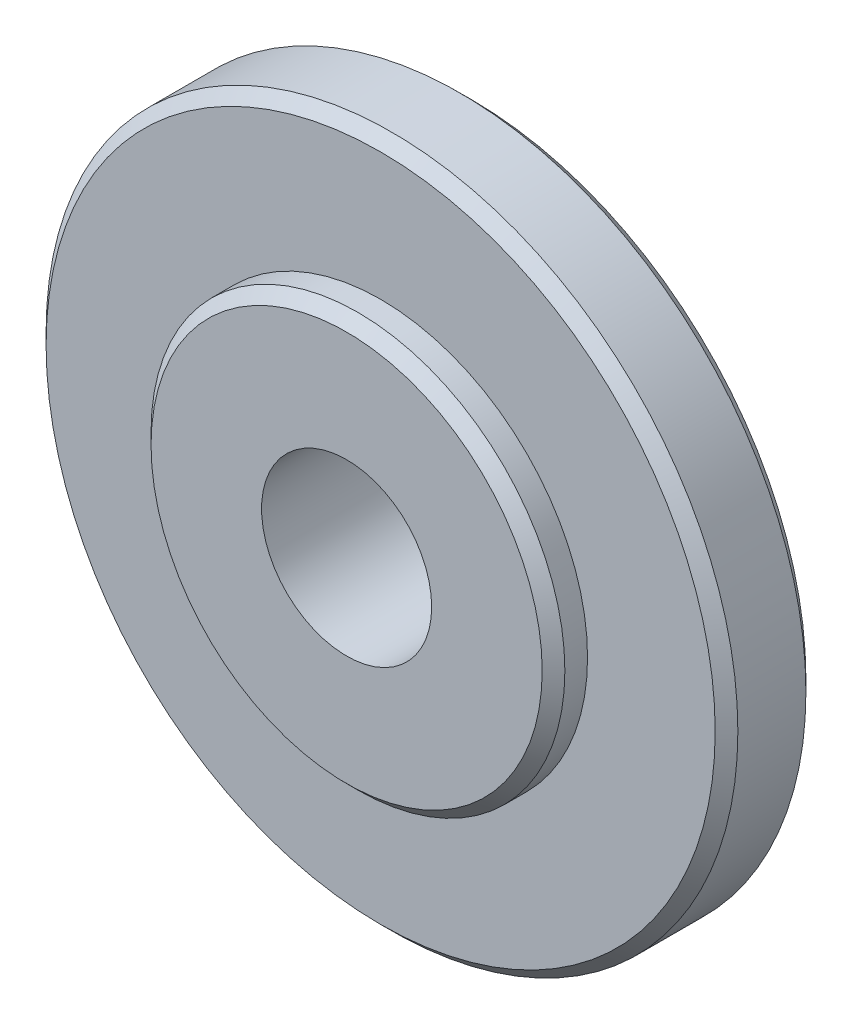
ISO-10303-21;
HEADER;
FILE_DESCRIPTION(('STEP AP214'),'2;1');
FILE_NAME('part.step','',(''),(''),'','','');
FILE_SCHEMA(('AUTOMOTIVE_DESIGN { 1 0 10303 214 1 1 1 1 }'));
ENDSEC;
DATA;
#1=APPLICATION_CONTEXT('core data for automotive mechanical design processes');
#2=APPLICATION_PROTOCOL_DEFINITION('international standard','automotive_design',2000,#1);
#3=PRODUCT_CONTEXT('',#1,'mechanical');
#4=PRODUCT('Part','Part','',(#3));
#5=PRODUCT_RELATED_PRODUCT_CATEGORY('part','',(#4));
#6=PRODUCT_DEFINITION_FORMATION('','',#4);
#7=PRODUCT_DEFINITION_CONTEXT('part definition',#1,'design');
#8=PRODUCT_DEFINITION('design','',#6,#7);
#9=PRODUCT_DEFINITION_SHAPE('','',#8);
#10=(LENGTH_UNIT() NAMED_UNIT(*) SI_UNIT(.MILLI.,.METRE.));
#11=(NAMED_UNIT(*) PLANE_ANGLE_UNIT() SI_UNIT($,.RADIAN.));
#12=(NAMED_UNIT(*) SI_UNIT($,.STERADIAN.) SOLID_ANGLE_UNIT());
#13=UNCERTAINTY_MEASURE_WITH_UNIT(LENGTH_MEASURE(1.E-05),#10,'distance_accuracy_value','');
#14=(GEOMETRIC_REPRESENTATION_CONTEXT(3) GLOBAL_UNCERTAINTY_ASSIGNED_CONTEXT((#13)) GLOBAL_UNIT_ASSIGNED_CONTEXT((#10,
#11,#12)) REPRESENTATION_CONTEXT('',''));
#15=CARTESIAN_POINT('',(0.,0.,0.));
#16=DIRECTION('',(0.,0.,1.));
#17=DIRECTION('',(1.,0.,0.));
#18=AXIS2_PLACEMENT_3D('',#15,#16,#17);
#19=CARTESIAN_POINT('',(0.,18.2451617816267,-3.));
#20=DIRECTION('',(0.,0.,-1.));
#21=DIRECTION('',(-1.,0.,0.));
#22=AXIS2_PLACEMENT_3D('',#19,#20,#21);
#23=PLANE('',#22);
#24=CARTESIAN_POINT('',(0.,0.,-3.));
#25=DIRECTION('',(0.,0.,1.));
#26=DIRECTION('',(1.,0.,0.));
#27=AXIS2_PLACEMENT_3D('',#24,#25,#26);
#28=CIRCLE('',#27,18.2451617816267);
#29=CARTESIAN_POINT('',(18.2451617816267,0.,-3.));
#30=VERTEX_POINT('',#29);
#31=EDGE_CURVE('E61',#30,#30,#28,.T.);
#32=ORIENTED_EDGE('',*,*,#31,.F.);
#33=EDGE_LOOP('',(#32));
#34=FACE_BOUND('',#33,.T.);
#35=CARTESIAN_POINT('',(0.,0.,-3.));
#36=DIRECTION('',(0.,0.,1.));
#37=DIRECTION('',(1.,0.,0.));
#38=AXIS2_PLACEMENT_3D('',#35,#36,#37);
#39=CIRCLE('',#38,29.5);
#40=CARTESIAN_POINT('',(29.5,0.,-3.));
#41=VERTEX_POINT('',#40);
#42=EDGE_CURVE('E10',#41,#41,#39,.T.);
#43=ORIENTED_EDGE('',*,*,#42,.T.);
#44=EDGE_LOOP('',(#43));
#45=FACE_BOUND('',#44,.T.);
#46=ADVANCED_FACE('F30',(#34,#45),#23,.F.);
#47=CARTESIAN_POINT('',(0.,0.,-4.));
#48=DIRECTION('',(0.,0.,-1.));
#49=DIRECTION('',(-1.,0.,0.));
#50=AXIS2_PLACEMENT_3D('',#47,#48,#49);
#51=CONICAL_SURFACE('',#50,30.5,0.78539816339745);
#52=ORIENTED_EDGE('',*,*,#42,.F.);
#53=EDGE_LOOP('',(#52));
#54=FACE_BOUND('',#53,.T.);
#55=CARTESIAN_POINT('',(0.,0.,-4.));
#56=DIRECTION('',(0.,0.,1.));
#57=DIRECTION('',(1.,0.,0.));
#58=AXIS2_PLACEMENT_3D('',#55,#56,#57);
#59=CIRCLE('',#58,30.5);
#60=CARTESIAN_POINT('',(30.5,0.,-4.));
#61=VERTEX_POINT('',#60);
#62=EDGE_CURVE('E36',#61,#61,#59,.T.);
#63=ORIENTED_EDGE('',*,*,#62,.T.);
#64=EDGE_LOOP('',(#63));
#65=FACE_BOUND('',#64,.T.);
#66=ADVANCED_FACE('F68',(#54,#65),#51,.T.);
#67=CARTESIAN_POINT('',(0.,0.,0.));
#68=DIRECTION('',(0.,0.,1.));
#69=DIRECTION('',(1.,0.,0.));
#70=AXIS2_PLACEMENT_3D('',#67,#68,#69);
#71=CYLINDRICAL_SURFACE('',#70,30.5);
#72=ORIENTED_EDGE('',*,*,#62,.F.);
#73=EDGE_LOOP('',(#72));
#74=FACE_BOUND('',#73,.T.);
#75=CARTESIAN_POINT('',(0.,0.,-10.));
#76=DIRECTION('',(0.,0.,1.));
#77=DIRECTION('',(1.,0.,0.));
#78=AXIS2_PLACEMENT_3D('',#75,#76,#77);
#79=CIRCLE('',#78,30.5);
#80=CARTESIAN_POINT('',(30.5,0.,-10.));
#81=VERTEX_POINT('',#80);
#82=EDGE_CURVE('E40',#81,#81,#79,.T.);
#83=ORIENTED_EDGE('',*,*,#82,.T.);
#84=EDGE_LOOP('',(#83));
#85=FACE_BOUND('',#84,.T.);
#86=ADVANCED_FACE('F72',(#74,#85),#71,.T.);
#87=CARTESIAN_POINT('',(0.,0.,-11.));
#88=DIRECTION('',(0.,0.,1.));
#89=DIRECTION('',(1.,0.,0.));
#90=AXIS2_PLACEMENT_3D('',#87,#88,#89);
#91=CONICAL_SURFACE('',#90,29.5,0.785398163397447);
#92=ORIENTED_EDGE('',*,*,#82,.F.);
#93=EDGE_LOOP('',(#92));
#94=FACE_BOUND('',#93,.T.);
#95=CARTESIAN_POINT('',(0.,0.,-11.));
#96=DIRECTION('',(0.,0.,1.));
#97=DIRECTION('',(1.,0.,0.));
#98=AXIS2_PLACEMENT_3D('',#95,#96,#97);
#99=CIRCLE('',#98,29.5);
#100=CARTESIAN_POINT('',(29.5,0.,-11.));
#101=VERTEX_POINT('',#100);
#102=EDGE_CURVE('E44',#101,#101,#99,.T.);
#103=ORIENTED_EDGE('',*,*,#102,.T.);
#104=EDGE_LOOP('',(#103));
#105=FACE_BOUND('',#104,.T.);
#106=ADVANCED_FACE('F77',(#94,#105),#91,.T.);
#107=CARTESIAN_POINT('',(0.,29.5,-11.));
#108=DIRECTION('',(0.,0.,1.));
#109=DIRECTION('',(1.,0.,0.));
#110=AXIS2_PLACEMENT_3D('',#107,#108,#109);
#111=PLANE('',#110);
#112=ORIENTED_EDGE('',*,*,#102,.F.);
#113=EDGE_LOOP('',(#112));
#114=FACE_BOUND('',#113,.T.);
#115=CARTESIAN_POINT('',(0.,0.,-11.));
#116=DIRECTION('',(0.,0.,1.));
#117=DIRECTION('',(1.,0.,0.));
#118=AXIS2_PLACEMENT_3D('',#115,#116,#117);
#119=CIRCLE('',#118,7.5);
#120=CARTESIAN_POINT('',(7.5,0.,-11.));
#121=VERTEX_POINT('',#120);
#122=EDGE_CURVE('E49',#121,#121,#119,.T.);
#123=ORIENTED_EDGE('',*,*,#122,.T.);
#124=EDGE_LOOP('',(#123));
#125=FACE_BOUND('',#124,.T.);
#126=ADVANCED_FACE('F83',(#114,#125),#111,.F.);
#127=CARTESIAN_POINT('',(0.,0.,0.));
#128=DIRECTION('',(0.,0.,1.));
#129=DIRECTION('',(1.,0.,0.));
#130=AXIS2_PLACEMENT_3D('',#127,#128,#129);
#131=CYLINDRICAL_SURFACE('',#130,7.5);
#132=ORIENTED_EDGE('',*,*,#122,.F.);
#133=EDGE_LOOP('',(#132));
#134=FACE_BOUND('',#133,.T.);
#135=CARTESIAN_POINT('',(0.,0.,0.));
#136=DIRECTION('',(0.,0.,1.));
#137=DIRECTION('',(1.,0.,0.));
#138=AXIS2_PLACEMENT_3D('',#135,#136,#137);
#139=CIRCLE('',#138,7.5);
#140=CARTESIAN_POINT('',(7.5,0.,0.));
#141=VERTEX_POINT('',#140);
#142=EDGE_CURVE('E52',#141,#141,#139,.T.);
#143=ORIENTED_EDGE('',*,*,#142,.T.);
#144=EDGE_LOOP('',(#143));
#145=FACE_BOUND('',#144,.T.);
#146=ADVANCED_FACE('F87',(#134,#145),#131,.F.);
#147=CARTESIAN_POINT('',(0.,7.5,0.));
#148=DIRECTION('',(0.,0.,-1.));
#149=DIRECTION('',(-1.,0.,0.));
#150=AXIS2_PLACEMENT_3D('',#147,#148,#149);
#151=PLANE('',#150);
#152=ORIENTED_EDGE('',*,*,#142,.F.);
#153=EDGE_LOOP('',(#152));
#154=FACE_BOUND('',#153,.T.);
#155=CARTESIAN_POINT('',(0.,0.,0.));
#156=DIRECTION('',(0.,0.,1.));
#157=DIRECTION('',(1.,0.,0.));
#158=AXIS2_PLACEMENT_3D('',#155,#156,#157);
#159=CIRCLE('',#158,17.2451617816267);
#160=CARTESIAN_POINT('',(17.2451617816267,0.,0.));
#161=VERTEX_POINT('',#160);
#162=EDGE_CURVE('E55',#161,#161,#159,.T.);
#163=ORIENTED_EDGE('',*,*,#162,.T.);
#164=EDGE_LOOP('',(#163));
#165=FACE_BOUND('',#164,.T.);
#166=ADVANCED_FACE('F91',(#154,#165),#151,.F.);
#167=CARTESIAN_POINT('',(0.,0.,-0.999999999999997));
#168=DIRECTION('',(0.,0.,-1.));
#169=DIRECTION('',(-1.,0.,0.));
#170=AXIS2_PLACEMENT_3D('',#167,#168,#169);
#171=CONICAL_SURFACE('',#170,18.2451617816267,0.78539816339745);
#172=ORIENTED_EDGE('',*,*,#162,.F.);
#173=EDGE_LOOP('',(#172));
#174=FACE_BOUND('',#173,.T.);
#175=CARTESIAN_POINT('',(0.,0.,-0.999999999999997));
#176=DIRECTION('',(0.,0.,1.));
#177=DIRECTION('',(1.,0.,0.));
#178=AXIS2_PLACEMENT_3D('',#175,#176,#177);
#179=CIRCLE('',#178,18.2451617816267);
#180=CARTESIAN_POINT('',(18.2451617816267,0.,-0.999999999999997));
#181=VERTEX_POINT('',#180);
#182=EDGE_CURVE('E58',#181,#181,#179,.T.);
#183=ORIENTED_EDGE('',*,*,#182,.T.);
#184=EDGE_LOOP('',(#183));
#185=FACE_BOUND('',#184,.T.);
#186=ADVANCED_FACE('F95',(#174,#185),#171,.T.);
#187=CARTESIAN_POINT('',(0.,0.,0.));
#188=DIRECTION('',(0.,0.,1.));
#189=DIRECTION('',(1.,0.,0.));
#190=AXIS2_PLACEMENT_3D('',#187,#188,#189);
#191=CYLINDRICAL_SURFACE('',#190,18.2451617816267);
#192=ORIENTED_EDGE('',*,*,#182,.F.);
#193=EDGE_LOOP('',(#192));
#194=FACE_BOUND('',#193,.T.);
#195=ORIENTED_EDGE('',*,*,#31,.T.);
#196=EDGE_LOOP('',(#195));
#197=FACE_BOUND('',#196,.T.);
#198=ADVANCED_FACE('F65',(#194,#197),#191,.T.);
#199=CLOSED_SHELL('',(#46,#66,#86,#106,#126,#146,#166,#186,#198));
#200=MANIFOLD_SOLID_BREP('B2',#199);
#201=ADVANCED_BREP_SHAPE_REPRESENTATION('',(#18,#200),#14);
#202=SHAPE_DEFINITION_REPRESENTATION(#9,#201);
ENDSEC;
END-ISO-10303-21;
